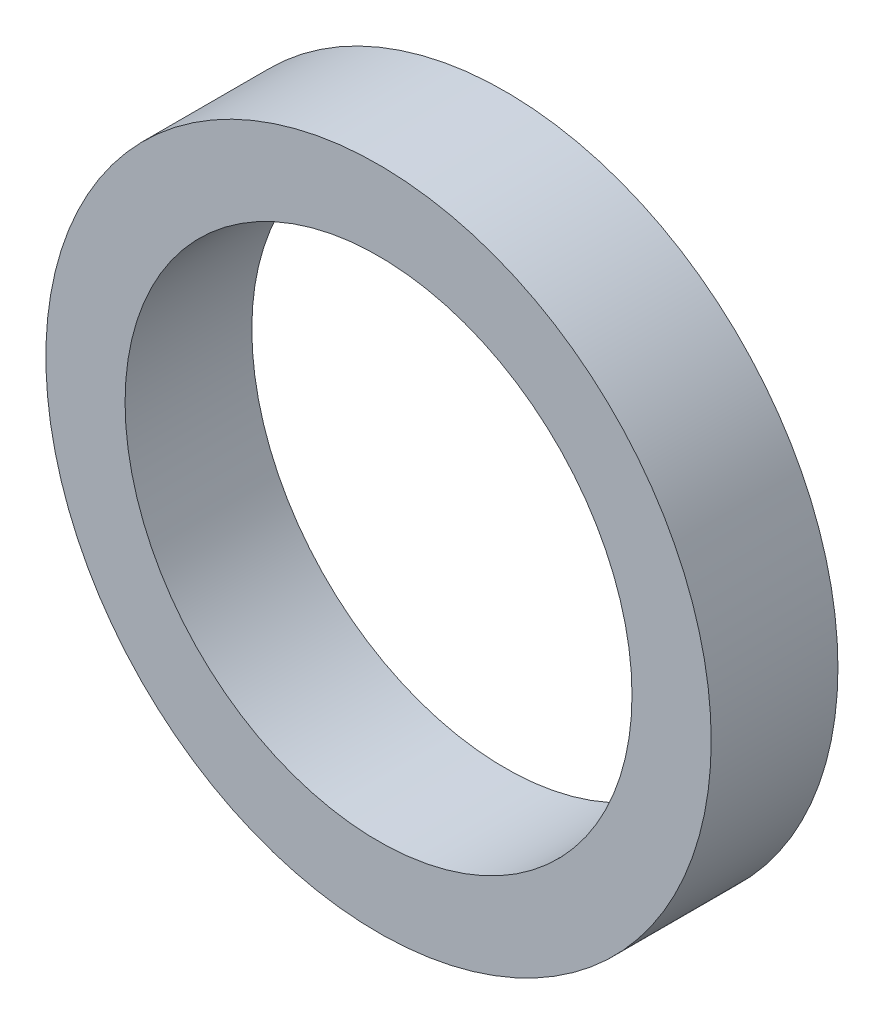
ISO-10303-21;
HEADER;
FILE_DESCRIPTION(('STEP AP214'),'2;1');
FILE_NAME('part.step','',(''),(''),'','','');
FILE_SCHEMA(('AUTOMOTIVE_DESIGN { 1 0 10303 214 1 1 1 1 }'));
ENDSEC;
DATA;
#1=APPLICATION_CONTEXT('core data for automotive mechanical design processes');
#2=APPLICATION_PROTOCOL_DEFINITION('international standard','automotive_design',2000,#1);
#3=PRODUCT_CONTEXT('',#1,'mechanical');
#4=PRODUCT('Part','Part','',(#3));
#5=PRODUCT_RELATED_PRODUCT_CATEGORY('part','',(#4));
#6=PRODUCT_DEFINITION_FORMATION('','',#4);
#7=PRODUCT_DEFINITION_CONTEXT('part definition',#1,'design');
#8=PRODUCT_DEFINITION('design','',#6,#7);
#9=PRODUCT_DEFINITION_SHAPE('','',#8);
#10=(LENGTH_UNIT() NAMED_UNIT(*) SI_UNIT(.MILLI.,.METRE.));
#11=(NAMED_UNIT(*) PLANE_ANGLE_UNIT() SI_UNIT($,.RADIAN.));
#12=(NAMED_UNIT(*) SI_UNIT($,.STERADIAN.) SOLID_ANGLE_UNIT());
#13=UNCERTAINTY_MEASURE_WITH_UNIT(LENGTH_MEASURE(1.E-05),#10,'distance_accuracy_value','');
#14=(GEOMETRIC_REPRESENTATION_CONTEXT(3) GLOBAL_UNCERTAINTY_ASSIGNED_CONTEXT((#13)) GLOBAL_UNIT_ASSIGNED_CONTEXT((#10,
#11,#12)) REPRESENTATION_CONTEXT('',''));
#15=CARTESIAN_POINT('',(0.,0.,0.));
#16=DIRECTION('',(0.,0.,1.));
#17=DIRECTION('',(1.,0.,0.));
#18=AXIS2_PLACEMENT_3D('',#15,#16,#17);
#19=CARTESIAN_POINT('',(0.,0.,4.));
#20=DIRECTION('',(0.,0.,-1.));
#21=DIRECTION('',(0.,1.,0.));
#22=AXIS2_PLACEMENT_3D('',#19,#20,#21);
#23=CYLINDRICAL_SURFACE('',#22,8.);
#24=CARTESIAN_POINT('',(0.,0.,4.));
#25=DIRECTION('',(0.,0.,-1.));
#26=DIRECTION('',(1.,0.,0.));
#27=AXIS2_PLACEMENT_3D('',#24,#25,#26);
#28=CIRCLE('',#27,8.);
#29=CARTESIAN_POINT('',(8.,0.,4.));
#30=VERTEX_POINT('',#29);
#31=EDGE_CURVE('E8',#30,#30,#28,.T.);
#32=ORIENTED_EDGE('',*,*,#31,.F.);
#33=EDGE_LOOP('',(#32));
#34=FACE_BOUND('',#33,.T.);
#35=CARTESIAN_POINT('',(0.,0.,0.));
#36=DIRECTION('',(0.,0.,-1.));
#37=DIRECTION('',(1.,0.,0.));
#38=AXIS2_PLACEMENT_3D('',#35,#36,#37);
#39=CIRCLE('',#38,8.);
#40=CARTESIAN_POINT('',(8.,0.,0.));
#41=VERTEX_POINT('',#40);
#42=EDGE_CURVE('E23',#41,#41,#39,.T.);
#43=ORIENTED_EDGE('',*,*,#42,.T.);
#44=EDGE_LOOP('',(#43));
#45=FACE_BOUND('',#44,.T.);
#46=ADVANCED_FACE('F12',(#34,#45),#23,.F.);
#47=CARTESIAN_POINT('',(0.,0.,4.));
#48=DIRECTION('',(0.,0.,-1.));
#49=DIRECTION('',(0.,1.,0.));
#50=AXIS2_PLACEMENT_3D('',#47,#48,#49);
#51=CYLINDRICAL_SURFACE('',#50,10.5);
#52=CARTESIAN_POINT('',(0.,0.,4.));
#53=DIRECTION('',(0.,0.,-1.));
#54=DIRECTION('',(1.,0.,0.));
#55=AXIS2_PLACEMENT_3D('',#52,#53,#54);
#56=CIRCLE('',#55,10.5);
#57=CARTESIAN_POINT('',(10.5,0.,4.));
#58=VERTEX_POINT('',#57);
#59=EDGE_CURVE('E19',#58,#58,#56,.T.);
#60=ORIENTED_EDGE('',*,*,#59,.T.);
#61=EDGE_LOOP('',(#60));
#62=FACE_BOUND('',#61,.T.);
#63=CARTESIAN_POINT('',(0.,0.,0.));
#64=DIRECTION('',(0.,0.,-1.));
#65=DIRECTION('',(1.,0.,0.));
#66=AXIS2_PLACEMENT_3D('',#63,#64,#65);
#67=CIRCLE('',#66,10.5);
#68=CARTESIAN_POINT('',(10.5,0.,0.));
#69=VERTEX_POINT('',#68);
#70=EDGE_CURVE('E28',#69,#69,#67,.T.);
#71=ORIENTED_EDGE('',*,*,#70,.F.);
#72=EDGE_LOOP('',(#71));
#73=FACE_BOUND('',#72,.T.);
#74=ADVANCED_FACE('F14',(#62,#73),#51,.T.);
#75=CARTESIAN_POINT('',(0.,0.,4.));
#76=DIRECTION('',(0.,0.,-1.));
#77=DIRECTION('',(0.,1.,0.));
#78=AXIS2_PLACEMENT_3D('',#75,#76,#77);
#79=PLANE('',#78);
#80=ORIENTED_EDGE('',*,*,#31,.T.);
#81=EDGE_LOOP('',(#80));
#82=FACE_BOUND('',#81,.T.);
#83=ORIENTED_EDGE('',*,*,#59,.F.);
#84=EDGE_LOOP('',(#83));
#85=FACE_BOUND('',#84,.T.);
#86=ADVANCED_FACE('F40',(#82,#85),#79,.F.);
#87=CARTESIAN_POINT('',(0.,0.,0.));
#88=DIRECTION('',(0.,0.,-1.));
#89=DIRECTION('',(0.,1.,0.));
#90=AXIS2_PLACEMENT_3D('',#87,#88,#89);
#91=PLANE('',#90);
#92=ORIENTED_EDGE('',*,*,#42,.F.);
#93=EDGE_LOOP('',(#92));
#94=FACE_BOUND('',#93,.T.);
#95=ORIENTED_EDGE('',*,*,#70,.T.);
#96=EDGE_LOOP('',(#95));
#97=FACE_BOUND('',#96,.T.);
#98=ADVANCED_FACE('F37',(#94,#97),#91,.T.);
#99=CLOSED_SHELL('',(#46,#74,#86,#98));
#100=MANIFOLD_SOLID_BREP('B1',#99);
#101=ADVANCED_BREP_SHAPE_REPRESENTATION('',(#18,#100),#14);
#102=SHAPE_DEFINITION_REPRESENTATION(#9,#101);
ENDSEC;
END-ISO-10303-21;
